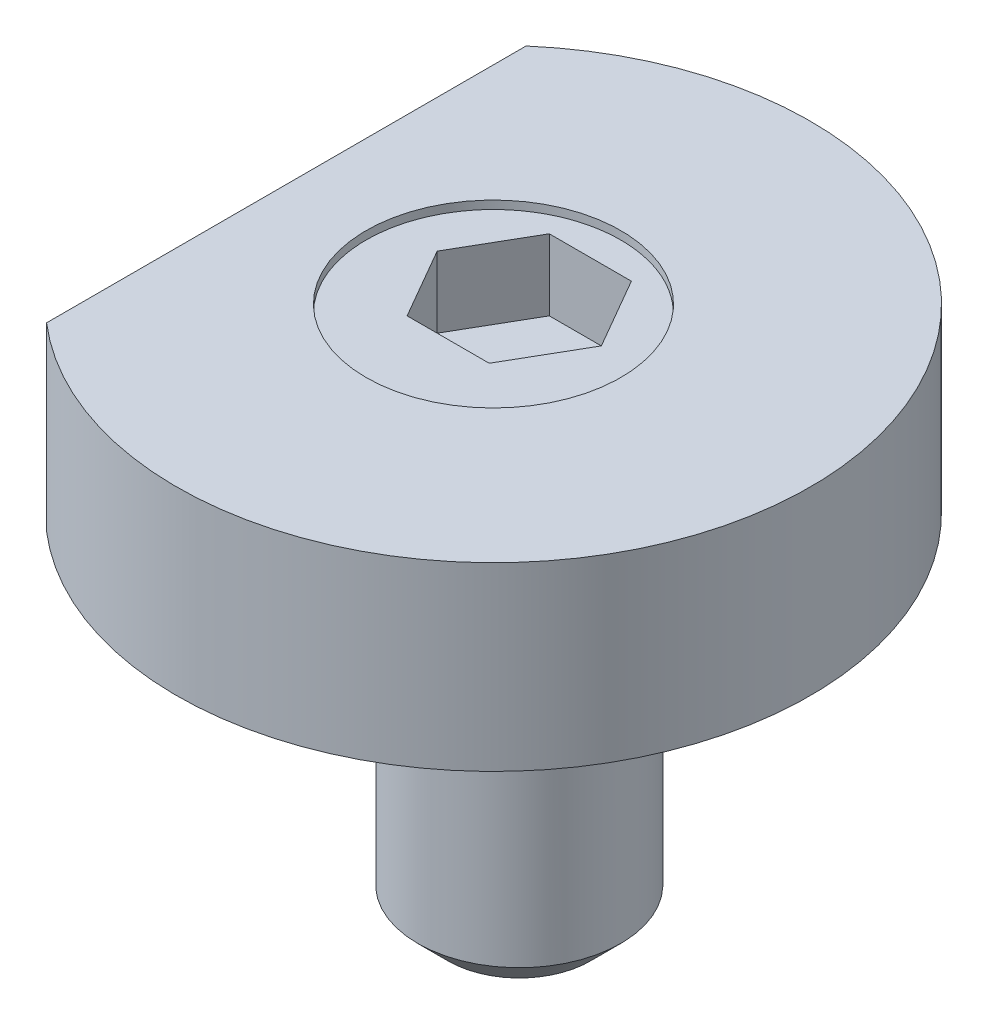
ISO-10303-21;
HEADER;
FILE_DESCRIPTION(('STEP AP214'),'2;1');
FILE_NAME('part.step','',(''),(''),'','','');
FILE_SCHEMA(('AUTOMOTIVE_DESIGN { 1 0 10303 214 1 1 1 1 }'));
ENDSEC;
DATA;
#1=APPLICATION_CONTEXT('core data for automotive mechanical design processes');
#2=APPLICATION_PROTOCOL_DEFINITION('international standard','automotive_design',2000,#1);
#3=PRODUCT_CONTEXT('',#1,'mechanical');
#4=PRODUCT('Part','Part','',(#3));
#5=PRODUCT_RELATED_PRODUCT_CATEGORY('part','',(#4));
#6=PRODUCT_DEFINITION_FORMATION('','',#4);
#7=PRODUCT_DEFINITION_CONTEXT('part definition',#1,'design');
#8=PRODUCT_DEFINITION('design','',#6,#7);
#9=PRODUCT_DEFINITION_SHAPE('','',#8);
#10=(LENGTH_UNIT() NAMED_UNIT(*) SI_UNIT(.MILLI.,.METRE.));
#11=(NAMED_UNIT(*) PLANE_ANGLE_UNIT() SI_UNIT($,.RADIAN.));
#12=(NAMED_UNIT(*) SI_UNIT($,.STERADIAN.) SOLID_ANGLE_UNIT());
#13=UNCERTAINTY_MEASURE_WITH_UNIT(LENGTH_MEASURE(1.E-05),#10,'distance_accuracy_value','');
#14=(GEOMETRIC_REPRESENTATION_CONTEXT(3) GLOBAL_UNCERTAINTY_ASSIGNED_CONTEXT((#13)) GLOBAL_UNIT_ASSIGNED_CONTEXT((#10,
#11,#12)) REPRESENTATION_CONTEXT('',''));
#15=CARTESIAN_POINT('',(0.,0.,0.));
#16=DIRECTION('',(0.,0.,1.));
#17=DIRECTION('',(1.,0.,0.));
#18=AXIS2_PLACEMENT_3D('',#15,#16,#17);
#19=CARTESIAN_POINT('',(0.,-18.,-1.27));
#20=DIRECTION('',(0.,1.,0.));
#21=DIRECTION('',(0.,0.,1.));
#22=AXIS2_PLACEMENT_3D('',#19,#20,#21);
#23=CYLINDRICAL_SURFACE('',#22,5.);
#24=CARTESIAN_POINT('',(0.,-16.5,-1.27));
#25=DIRECTION('',(0.,1.,0.));
#26=DIRECTION('',(0.,0.,1.));
#27=AXIS2_PLACEMENT_3D('',#24,#25,#26);
#28=CIRCLE('',#27,5.);
#29=CARTESIAN_POINT('',(0.,-16.5,3.73));
#30=VERTEX_POINT('',#29);
#31=EDGE_CURVE('P0_E24',#30,#30,#28,.T.);
#32=ORIENTED_EDGE('',*,*,#31,.T.);
#33=EDGE_LOOP('',(#32));
#34=FACE_BOUND('',#33,.T.);
#35=CARTESIAN_POINT('',(0.,2.,-1.27));
#36=DIRECTION('',(0.,1.,0.));
#37=DIRECTION('',(0.,0.,1.));
#38=AXIS2_PLACEMENT_3D('',#35,#36,#37);
#39=CIRCLE('',#38,5.);
#40=CARTESIAN_POINT('',(0.,2.,-6.27));
#41=VERTEX_POINT('',#40);
#42=EDGE_CURVE('P0_E37',#41,#41,#39,.T.);
#43=ORIENTED_EDGE('',*,*,#42,.F.);
#44=EDGE_LOOP('',(#43));
#45=FACE_BOUND('',#44,.T.);
#46=ADVANCED_FACE('P0_F16',(#34,#45),#23,.T.);
#47=CARTESIAN_POINT('',(0.,-18.,-1.27));
#48=DIRECTION('',(0.,1.,0.));
#49=DIRECTION('',(0.,0.,1.));
#50=AXIS2_PLACEMENT_3D('',#47,#48,#49);
#51=PLANE('',#50);
#52=CARTESIAN_POINT('',(0.,-18.,-1.27));
#53=DIRECTION('',(0.,1.,0.));
#54=DIRECTION('',(0.,0.,1.));
#55=AXIS2_PLACEMENT_3D('',#52,#53,#54);
#56=CIRCLE('',#55,3.5);
#57=CARTESIAN_POINT('',(0.,-18.,2.23));
#58=VERTEX_POINT('',#57);
#59=EDGE_CURVE('P0_E11',#58,#58,#56,.F.);
#60=ORIENTED_EDGE('',*,*,#59,.T.);
#61=EDGE_LOOP('',(#60));
#62=FACE_BOUND('',#61,.T.);
#63=ADVANCED_FACE('P0_F137',(#62),#51,.F.);
#64=CARTESIAN_POINT('',(0.,-16.5,-1.27));
#65=DIRECTION('',(0.,1.,0.));
#66=DIRECTION('',(0.,0.,1.));
#67=AXIS2_PLACEMENT_3D('',#64,#65,#66);
#68=CONICAL_SURFACE('',#67,5.,0.785398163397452);
#69=ORIENTED_EDGE('',*,*,#59,.F.);
#70=EDGE_LOOP('',(#69));
#71=FACE_BOUND('',#70,.T.);
#72=ORIENTED_EDGE('',*,*,#31,.F.);
#73=EDGE_LOOP('',(#72));
#74=FACE_BOUND('',#73,.T.);
#75=ADVANCED_FACE('P0_F18',(#71,#74),#68,.T.);
#76=CARTESIAN_POINT('',(0.,2.,0.));
#77=DIRECTION('',(0.,1.,0.));
#78=DIRECTION('',(0.,0.,1.));
#79=AXIS2_PLACEMENT_3D('',#76,#77,#78);
#80=PLANE('',#79);
#81=CARTESIAN_POINT('',(0.,2.,0.));
#82=DIRECTION('',(0.,1.,0.));
#83=DIRECTION('',(0.,0.,1.));
#84=AXIS2_PLACEMENT_3D('',#81,#82,#83);
#85=CIRCLE('',#84,6.27);
#86=EDGE_CURVE('P0_E118',#41,#41,#85,.T.);
#87=ORIENTED_EDGE('',*,*,#86,.F.);
#88=ORIENTED_EDGE('',*,*,#42,.T.);
#89=EDGE_LOOP('',(#87,#88));
#90=FACE_BOUND('',#89,.T.);
#91=ADVANCED_FACE('P0_F136',(#90),#80,.F.);
#92=CARTESIAN_POINT('',(0.,8.5,0.));
#93=DIRECTION('',(0.,-1.,0.));
#94=DIRECTION('',(0.,0.,-1.));
#95=AXIS2_PLACEMENT_3D('',#92,#93,#94);
#96=CYLINDRICAL_SURFACE('',#95,6.27);
#97=CARTESIAN_POINT('',(0.,8.5,0.));
#98=DIRECTION('',(0.,1.,0.));
#99=DIRECTION('',(0.,0.,1.));
#100=AXIS2_PLACEMENT_3D('',#97,#98,#99);
#101=CIRCLE('',#100,6.27);
#102=CARTESIAN_POINT('',(0.,8.5,6.27));
#103=VERTEX_POINT('',#102);
#104=EDGE_CURVE('P0_E126',#103,#103,#101,.T.);
#105=ORIENTED_EDGE('',*,*,#104,.F.);
#106=EDGE_LOOP('',(#105));
#107=FACE_BOUND('',#106,.T.);
#108=ORIENTED_EDGE('',*,*,#86,.T.);
#109=EDGE_LOOP('',(#108));
#110=FACE_BOUND('',#109,.T.);
#111=ADVANCED_FACE('P0_F144',(#107,#110),#96,.T.);
#112=CARTESIAN_POINT('',(0.,8.5,0.));
#113=DIRECTION('',(0.,1.,0.));
#114=DIRECTION('',(0.,0.,1.));
#115=AXIS2_PLACEMENT_3D('',#112,#113,#114);
#116=PLANE('',#115);
#117=DIRECTION('',(-0.5,0.,-0.866025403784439));
#118=VECTOR('',#117,1.);
#119=CARTESIAN_POINT('',(4.04145188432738,8.5,-1.27));
#120=LINE('',#119,#118);
#121=CARTESIAN_POINT('',(4.04145188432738,8.5,-1.27));
#122=VERTEX_POINT('',#121);
#123=CARTESIAN_POINT('',(2.02072594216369,8.5,-4.77));
#124=VERTEX_POINT('',#123);
#125=EDGE_CURVE('P0_E31',#122,#124,#120,.T.);
#126=ORIENTED_EDGE('',*,*,#125,.F.);
#127=DIRECTION('',(0.5,0.,-0.866025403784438));
#128=VECTOR('',#127,1.);
#129=CARTESIAN_POINT('',(2.02072594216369,8.5,2.23));
#130=LINE('',#129,#128);
#131=CARTESIAN_POINT('',(2.02072594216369,8.5,2.23));
#132=VERTEX_POINT('',#131);
#133=EDGE_CURVE('P0_E92',#132,#122,#130,.T.);
#134=ORIENTED_EDGE('',*,*,#133,.F.);
#135=DIRECTION('',(1.,0.,0.));
#136=VECTOR('',#135,1.);
#137=CARTESIAN_POINT('',(-2.02072594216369,8.5,2.23));
#138=LINE('',#137,#136);
#139=CARTESIAN_POINT('',(-2.02072594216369,8.5,2.23));
#140=VERTEX_POINT('',#139);
#141=EDGE_CURVE('P0_E95',#140,#132,#138,.T.);
#142=ORIENTED_EDGE('',*,*,#141,.F.);
#143=DIRECTION('',(0.5,0.,0.866025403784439));
#144=VECTOR('',#143,1.);
#145=CARTESIAN_POINT('',(-4.04145188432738,8.5,-1.27));
#146=LINE('',#145,#144);
#147=CARTESIAN_POINT('',(-4.04145188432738,8.5,-1.27));
#148=VERTEX_POINT('',#147);
#149=EDGE_CURVE('P0_E111',#148,#140,#146,.T.);
#150=ORIENTED_EDGE('',*,*,#149,.F.);
#151=DIRECTION('',(-0.5,0.,0.866025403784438));
#152=VECTOR('',#151,1.);
#153=CARTESIAN_POINT('',(-2.02072594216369,8.5,-4.77));
#154=LINE('',#153,#152);
#155=CARTESIAN_POINT('',(-2.02072594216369,8.5,-4.77));
#156=VERTEX_POINT('',#155);
#157=EDGE_CURVE('P0_E108',#156,#148,#154,.T.);
#158=ORIENTED_EDGE('',*,*,#157,.F.);
#159=DIRECTION('',(-1.,0.,0.));
#160=VECTOR('',#159,1.);
#161=CARTESIAN_POINT('',(2.02072594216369,8.5,-4.77));
#162=LINE('',#161,#160);
#163=EDGE_CURVE('P0_E106',#124,#156,#162,.T.);
#164=ORIENTED_EDGE('',*,*,#163,.F.);
#165=EDGE_LOOP('',(#126,#134,#142,#150,#158,#164));
#166=FACE_BOUND('',#165,.T.);
#167=ORIENTED_EDGE('',*,*,#104,.T.);
#168=EDGE_LOOP('',(#167));
#169=FACE_BOUND('',#168,.T.);
#170=ADVANCED_FACE('P0_F155',(#166,#169),#116,.T.);
#171=CARTESIAN_POINT('',(4.04145188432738,5.,-1.27));
#172=DIRECTION('',(0.866025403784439,0.,-0.5));
#173=DIRECTION('',(-0.5,0.,-0.866025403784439));
#174=AXIS2_PLACEMENT_3D('',#171,#172,#173);
#175=PLANE('',#174);
#176=ORIENTED_EDGE('',*,*,#125,.T.);
#177=DIRECTION('',(0.,1.,0.));
#178=VECTOR('',#177,1.);
#179=CARTESIAN_POINT('',(2.02072594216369,5.,-4.77));
#180=LINE('',#179,#178);
#181=CARTESIAN_POINT('',(2.02072594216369,5.,-4.77));
#182=VERTEX_POINT('',#181);
#183=EDGE_CURVE('P0_E69',#182,#124,#180,.T.);
#184=ORIENTED_EDGE('',*,*,#183,.F.);
#185=DIRECTION('',(-0.5,0.,-0.866025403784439));
#186=VECTOR('',#185,1.);
#187=CARTESIAN_POINT('',(4.04145188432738,5.,-1.27));
#188=LINE('',#187,#186);
#189=CARTESIAN_POINT('',(4.04145188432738,5.,-1.27));
#190=VERTEX_POINT('',#189);
#191=EDGE_CURVE('P0_E73',#190,#182,#188,.T.);
#192=ORIENTED_EDGE('',*,*,#191,.F.);
#193=DIRECTION('',(0.,1.,0.));
#194=VECTOR('',#193,1.);
#195=CARTESIAN_POINT('',(4.04145188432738,5.,-1.27));
#196=LINE('',#195,#194);
#197=EDGE_CURVE('P0_E116',#190,#122,#196,.T.);
#198=ORIENTED_EDGE('',*,*,#197,.T.);
#199=EDGE_LOOP('',(#176,#184,#192,#198));
#200=FACE_BOUND('',#199,.T.);
#201=ADVANCED_FACE('P0_F71',(#200),#175,.F.);
#202=CARTESIAN_POINT('',(2.02072594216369,5.,2.23));
#203=DIRECTION('',(0.866025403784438,0.,0.5));
#204=DIRECTION('',(0.5,0.,-0.866025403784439));
#205=AXIS2_PLACEMENT_3D('',#202,#203,#204);
#206=PLANE('',#205);
#207=ORIENTED_EDGE('',*,*,#133,.T.);
#208=ORIENTED_EDGE('',*,*,#197,.F.);
#209=DIRECTION('',(0.5,0.,-0.866025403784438));
#210=VECTOR('',#209,1.);
#211=CARTESIAN_POINT('',(2.02072594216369,5.,2.23));
#212=LINE('',#211,#210);
#213=CARTESIAN_POINT('',(2.02072594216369,5.,2.23));
#214=VERTEX_POINT('',#213);
#215=EDGE_CURVE('P0_E79',#214,#190,#212,.T.);
#216=ORIENTED_EDGE('',*,*,#215,.F.);
#217=DIRECTION('',(0.,1.,0.));
#218=VECTOR('',#217,1.);
#219=CARTESIAN_POINT('',(2.02072594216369,5.,2.23));
#220=LINE('',#219,#218);
#221=EDGE_CURVE('P0_E119',#214,#132,#220,.T.);
#222=ORIENTED_EDGE('',*,*,#221,.T.);
#223=EDGE_LOOP('',(#207,#208,#216,#222));
#224=FACE_BOUND('',#223,.T.);
#225=ADVANCED_FACE('P0_F163',(#224),#206,.F.);
#226=CARTESIAN_POINT('',(-2.02072594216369,5.,2.23));
#227=DIRECTION('',(0.,0.,1.));
#228=DIRECTION('',(1.,0.,0.));
#229=AXIS2_PLACEMENT_3D('',#226,#227,#228);
#230=PLANE('',#229);
#231=ORIENTED_EDGE('',*,*,#141,.T.);
#232=ORIENTED_EDGE('',*,*,#221,.F.);
#233=DIRECTION('',(1.,0.,0.));
#234=VECTOR('',#233,1.);
#235=CARTESIAN_POINT('',(-2.02072594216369,5.,2.23));
#236=LINE('',#235,#234);
#237=CARTESIAN_POINT('',(-2.02072594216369,5.,2.23));
#238=VERTEX_POINT('',#237);
#239=EDGE_CURVE('P0_E102',#238,#214,#236,.T.);
#240=ORIENTED_EDGE('',*,*,#239,.F.);
#241=DIRECTION('',(0.,1.,0.));
#242=VECTOR('',#241,1.);
#243=CARTESIAN_POINT('',(-2.02072594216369,5.,2.23));
#244=LINE('',#243,#242);
#245=EDGE_CURVE('P0_E121',#238,#140,#244,.T.);
#246=ORIENTED_EDGE('',*,*,#245,.T.);
#247=EDGE_LOOP('',(#231,#232,#240,#246));
#248=FACE_BOUND('',#247,.T.);
#249=ADVANCED_FACE('P0_F173',(#248),#230,.F.);
#250=CARTESIAN_POINT('',(-4.04145188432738,5.,-1.27));
#251=DIRECTION('',(-0.866025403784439,0.,0.5));
#252=DIRECTION('',(0.5,0.,0.866025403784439));
#253=AXIS2_PLACEMENT_3D('',#250,#251,#252);
#254=PLANE('',#253);
#255=ORIENTED_EDGE('',*,*,#149,.T.);
#256=ORIENTED_EDGE('',*,*,#245,.F.);
#257=DIRECTION('',(0.5,0.,0.866025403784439));
#258=VECTOR('',#257,1.);
#259=CARTESIAN_POINT('',(-4.04145188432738,5.,-1.27));
#260=LINE('',#259,#258);
#261=CARTESIAN_POINT('',(-4.04145188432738,5.,-1.27));
#262=VERTEX_POINT('',#261);
#263=EDGE_CURVE('P0_E99',#262,#238,#260,.T.);
#264=ORIENTED_EDGE('',*,*,#263,.F.);
#265=DIRECTION('',(0.,1.,0.));
#266=VECTOR('',#265,1.);
#267=CARTESIAN_POINT('',(-4.04145188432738,5.,-1.27));
#268=LINE('',#267,#266);
#269=EDGE_CURVE('P0_E123',#262,#148,#268,.T.);
#270=ORIENTED_EDGE('',*,*,#269,.T.);
#271=EDGE_LOOP('',(#255,#256,#264,#270));
#272=FACE_BOUND('',#271,.T.);
#273=ADVANCED_FACE('P0_F169',(#272),#254,.F.);
#274=CARTESIAN_POINT('',(-2.02072594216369,5.,-4.77));
#275=DIRECTION('',(-0.866025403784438,0.,-0.5));
#276=DIRECTION('',(-0.5,0.,0.866025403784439));
#277=AXIS2_PLACEMENT_3D('',#274,#275,#276);
#278=PLANE('',#277);
#279=ORIENTED_EDGE('',*,*,#157,.T.);
#280=ORIENTED_EDGE('',*,*,#269,.F.);
#281=DIRECTION('',(-0.5,0.,0.866025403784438));
#282=VECTOR('',#281,1.);
#283=CARTESIAN_POINT('',(-2.02072594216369,5.,-4.77));
#284=LINE('',#283,#282);
#285=CARTESIAN_POINT('',(-2.02072594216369,5.,-4.77));
#286=VERTEX_POINT('',#285);
#287=EDGE_CURVE('P0_E87',#286,#262,#284,.T.);
#288=ORIENTED_EDGE('',*,*,#287,.F.);
#289=DIRECTION('',(0.,1.,0.));
#290=VECTOR('',#289,1.);
#291=CARTESIAN_POINT('',(-2.02072594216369,5.,-4.77));
#292=LINE('',#291,#290);
#293=EDGE_CURVE('P0_E78',#286,#156,#292,.T.);
#294=ORIENTED_EDGE('',*,*,#293,.T.);
#295=EDGE_LOOP('',(#279,#280,#288,#294));
#296=FACE_BOUND('',#295,.T.);
#297=ADVANCED_FACE('P0_F166',(#296),#278,.F.);
#298=CARTESIAN_POINT('',(2.02072594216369,5.,-4.77));
#299=DIRECTION('',(0.,0.,-1.));
#300=DIRECTION('',(-1.,0.,0.));
#301=AXIS2_PLACEMENT_3D('',#298,#299,#300);
#302=PLANE('',#301);
#303=ORIENTED_EDGE('',*,*,#163,.T.);
#304=ORIENTED_EDGE('',*,*,#293,.F.);
#305=DIRECTION('',(-1.,0.,0.));
#306=VECTOR('',#305,1.);
#307=CARTESIAN_POINT('',(2.02072594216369,5.,-4.77));
#308=LINE('',#307,#306);
#309=EDGE_CURVE('P0_E82',#182,#286,#308,.T.);
#310=ORIENTED_EDGE('',*,*,#309,.F.);
#311=ORIENTED_EDGE('',*,*,#183,.T.);
#312=EDGE_LOOP('',(#303,#304,#310,#311));
#313=FACE_BOUND('',#312,.T.);
#314=ADVANCED_FACE('P0_F83',(#313),#302,.F.);
#315=CARTESIAN_POINT('',(2.02072594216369,5.,-4.77));
#316=DIRECTION('',(0.,1.,0.));
#317=DIRECTION('',(0.,0.,1.));
#318=AXIS2_PLACEMENT_3D('',#315,#316,#317);
#319=PLANE('',#318);
#320=ORIENTED_EDGE('',*,*,#191,.T.);
#321=ORIENTED_EDGE('',*,*,#309,.T.);
#322=ORIENTED_EDGE('',*,*,#287,.T.);
#323=ORIENTED_EDGE('',*,*,#263,.T.);
#324=ORIENTED_EDGE('',*,*,#239,.T.);
#325=ORIENTED_EDGE('',*,*,#215,.T.);
#326=EDGE_LOOP('',(#320,#321,#322,#323,#324,#325));
#327=FACE_BOUND('',#326,.T.);
#328=ADVANCED_FACE('P0_F89',(#327),#319,.T.);
#329=CLOSED_SHELL('',(#46,#63,#75,#91,#111,#170,#201,#225,#249,#273,#297,#314,#328));
#330=MANIFOLD_SOLID_BREP('P0_B1',#329);
#331=CARTESIAN_POINT('',(0.,8.9,-1.27));
#332=DIRECTION('',(0.,-1.,0.));
#333=DIRECTION('',(0.,0.,-1.));
#334=AXIS2_PLACEMENT_3D('',#331,#332,#333);
#335=CYLINDRICAL_SURFACE('',#334,5.);
#336=CARTESIAN_POINT('',(0.,0.,-1.27));
#337=DIRECTION('',(0.,1.,0.));
#338=DIRECTION('',(0.,0.,1.));
#339=AXIS2_PLACEMENT_3D('',#336,#337,#338);
#340=CIRCLE('',#339,5.);
#341=CARTESIAN_POINT('',(0.,0.,3.73));
#342=VERTEX_POINT('',#341);
#343=EDGE_CURVE('P1_E61',#342,#342,#340,.T.);
#344=ORIENTED_EDGE('',*,*,#343,.F.);
#345=EDGE_LOOP('',(#344));
#346=FACE_BOUND('',#345,.T.);
#347=CARTESIAN_POINT('',(0.,2.,-1.27));
#348=DIRECTION('',(0.,1.,0.));
#349=DIRECTION('',(0.,0.,1.));
#350=AXIS2_PLACEMENT_3D('',#347,#348,#349);
#351=CIRCLE('',#350,5.);
#352=CARTESIAN_POINT('',(0.,2.,-6.27));
#353=VERTEX_POINT('',#352);
#354=EDGE_CURVE('P1_E10',#353,#353,#351,.T.);
#355=ORIENTED_EDGE('',*,*,#354,.T.);
#356=EDGE_LOOP('',(#355));
#357=FACE_BOUND('',#356,.T.);
#358=ADVANCED_FACE('P1_F15',(#346,#357),#335,.F.);
#359=CARTESIAN_POINT('',(0.,8.9,0.));
#360=DIRECTION('',(0.,1.,0.));
#361=DIRECTION('',(0.,0.,1.));
#362=AXIS2_PLACEMENT_3D('',#359,#360,#361);
#363=PLANE('',#362);
#364=CARTESIAN_POINT('',(0.,8.9,0.));
#365=DIRECTION('',(0.,1.,0.));
#366=DIRECTION('',(0.,0.,1.));
#367=AXIS2_PLACEMENT_3D('',#364,#365,#366);
#368=CIRCLE('',#367,6.27);
#369=CARTESIAN_POINT('',(0.,8.9,6.27));
#370=VERTEX_POINT('',#369);
#371=EDGE_CURVE('P1_E68',#370,#370,#368,.T.);
#372=ORIENTED_EDGE('',*,*,#371,.F.);
#373=EDGE_LOOP('',(#372));
#374=FACE_BOUND('',#373,.T.);
#375=CARTESIAN_POINT('',(0.,8.9,0.));
#376=DIRECTION('',(0.,1.,0.));
#377=DIRECTION('',(0.,0.,1.));
#378=AXIS2_PLACEMENT_3D('',#375,#376,#377);
#379=CIRCLE('',#378,15.6);
#380=CARTESIAN_POINT('',(-10.2,8.9,11.8033893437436));
#381=VERTEX_POINT('',#380);
#382=CARTESIAN_POINT('',(-10.2,8.9,-11.8033893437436));
#383=VERTEX_POINT('',#382);
#384=EDGE_CURVE('P1_E54',#381,#383,#379,.T.);
#385=ORIENTED_EDGE('',*,*,#384,.T.);
#386=DIRECTION('',(0.,0.,1.));
#387=VECTOR('',#386,1.);
#388=CARTESIAN_POINT('',(-10.2,8.9,-11.8033893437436));
#389=LINE('',#388,#387);
#390=EDGE_CURVE('P1_E35',#383,#381,#389,.T.);
#391=ORIENTED_EDGE('',*,*,#390,.T.);
#392=EDGE_LOOP('',(#385,#391));
#393=FACE_BOUND('',#392,.T.);
#394=ADVANCED_FACE('P1_F76',(#374,#393),#363,.T.);
#395=CARTESIAN_POINT('',(0.,0.,0.));
#396=DIRECTION('',(0.,1.,0.));
#397=DIRECTION('',(0.,0.,1.));
#398=AXIS2_PLACEMENT_3D('',#395,#396,#397);
#399=PLANE('',#398);
#400=CARTESIAN_POINT('',(0.,0.,0.));
#401=DIRECTION('',(0.,1.,0.));
#402=DIRECTION('',(0.,0.,1.));
#403=AXIS2_PLACEMENT_3D('',#400,#401,#402);
#404=CIRCLE('',#403,15.6);
#405=CARTESIAN_POINT('',(-10.2,0.,11.8033893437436));
#406=VERTEX_POINT('',#405);
#407=CARTESIAN_POINT('',(-10.2,0.,-11.8033893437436));
#408=VERTEX_POINT('',#407);
#409=EDGE_CURVE('P1_E55',#406,#408,#404,.T.);
#410=ORIENTED_EDGE('',*,*,#409,.F.);
#411=DIRECTION('',(0.,0.,1.));
#412=VECTOR('',#411,1.);
#413=CARTESIAN_POINT('',(-10.2,0.,-11.8033893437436));
#414=LINE('',#413,#412);
#415=EDGE_CURVE('P1_E45',#408,#406,#414,.T.);
#416=ORIENTED_EDGE('',*,*,#415,.F.);
#417=EDGE_LOOP('',(#410,#416));
#418=FACE_BOUND('',#417,.T.);
#419=ORIENTED_EDGE('',*,*,#343,.T.);
#420=EDGE_LOOP('',(#419));
#421=FACE_BOUND('',#420,.T.);
#422=ADVANCED_FACE('P1_F59',(#418,#421),#399,.F.);
#423=CARTESIAN_POINT('',(0.,8.9,0.));
#424=DIRECTION('',(0.,-1.,0.));
#425=DIRECTION('',(0.,0.,-1.));
#426=AXIS2_PLACEMENT_3D('',#423,#424,#425);
#427=CYLINDRICAL_SURFACE('',#426,15.6);
#428=ORIENTED_EDGE('',*,*,#409,.T.);
#429=DIRECTION('',(0.,-1.,0.));
#430=VECTOR('',#429,1.);
#431=CARTESIAN_POINT('',(-10.2,8.9,-11.8033893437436));
#432=LINE('',#431,#430);
#433=EDGE_CURVE('P1_E23',#383,#408,#432,.T.);
#434=ORIENTED_EDGE('',*,*,#433,.F.);
#435=ORIENTED_EDGE('',*,*,#384,.F.);
#436=DIRECTION('',(0.,-1.,0.));
#437=VECTOR('',#436,1.);
#438=CARTESIAN_POINT('',(-10.2,8.9,11.8033893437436));
#439=LINE('',#438,#437);
#440=EDGE_CURVE('P1_E48',#381,#406,#439,.T.);
#441=ORIENTED_EDGE('',*,*,#440,.T.);
#442=EDGE_LOOP('',(#428,#434,#435,#441));
#443=FACE_BOUND('',#442,.T.);
#444=ADVANCED_FACE('P1_F17',(#443),#427,.T.);
#445=CARTESIAN_POINT('',(-10.2,8.9,-11.8033893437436));
#446=DIRECTION('',(1.,0.,0.));
#447=DIRECTION('',(0.,0.,-1.));
#448=AXIS2_PLACEMENT_3D('',#445,#446,#447);
#449=PLANE('',#448);
#450=ORIENTED_EDGE('',*,*,#415,.T.);
#451=ORIENTED_EDGE('',*,*,#440,.F.);
#452=ORIENTED_EDGE('',*,*,#390,.F.);
#453=ORIENTED_EDGE('',*,*,#433,.T.);
#454=EDGE_LOOP('',(#450,#451,#452,#453));
#455=FACE_BOUND('',#454,.T.);
#456=ADVANCED_FACE('P1_F47',(#455),#449,.F.);
#457=CARTESIAN_POINT('',(0.,2.,0.));
#458=DIRECTION('',(0.,1.,0.));
#459=DIRECTION('',(0.,0.,1.));
#460=AXIS2_PLACEMENT_3D('',#457,#458,#459);
#461=CYLINDRICAL_SURFACE('',#460,6.27);
#462=ORIENTED_EDGE('',*,*,#371,.T.);
#463=EDGE_LOOP('',(#462));
#464=FACE_BOUND('',#463,.T.);
#465=CARTESIAN_POINT('',(0.,2.,0.));
#466=DIRECTION('',(0.,1.,0.));
#467=DIRECTION('',(0.,0.,1.));
#468=AXIS2_PLACEMENT_3D('',#465,#466,#467);
#469=CIRCLE('',#468,6.27);
#470=EDGE_CURVE('P1_E28',#353,#353,#469,.T.);
#471=ORIENTED_EDGE('',*,*,#470,.F.);
#472=EDGE_LOOP('',(#471));
#473=FACE_BOUND('',#472,.T.);
#474=ADVANCED_FACE('P1_F87',(#464,#473),#461,.F.);
#475=CARTESIAN_POINT('',(0.,2.,0.));
#476=DIRECTION('',(0.,1.,0.));
#477=DIRECTION('',(0.,0.,1.));
#478=AXIS2_PLACEMENT_3D('',#475,#476,#477);
#479=PLANE('',#478);
#480=ORIENTED_EDGE('',*,*,#470,.T.);
#481=ORIENTED_EDGE('',*,*,#354,.F.);
#482=EDGE_LOOP('',(#480,#481));
#483=FACE_BOUND('',#482,.T.);
#484=ADVANCED_FACE('P1_F73',(#483),#479,.T.);
#485=CLOSED_SHELL('',(#358,#394,#422,#444,#456,#474,#484));
#486=MANIFOLD_SOLID_BREP('P1_B1',#485);
#487=ADVANCED_BREP_SHAPE_REPRESENTATION('',(#18,#330,#486),#14);
#488=SHAPE_DEFINITION_REPRESENTATION(#9,#487);
ENDSEC;
END-ISO-10303-21;
